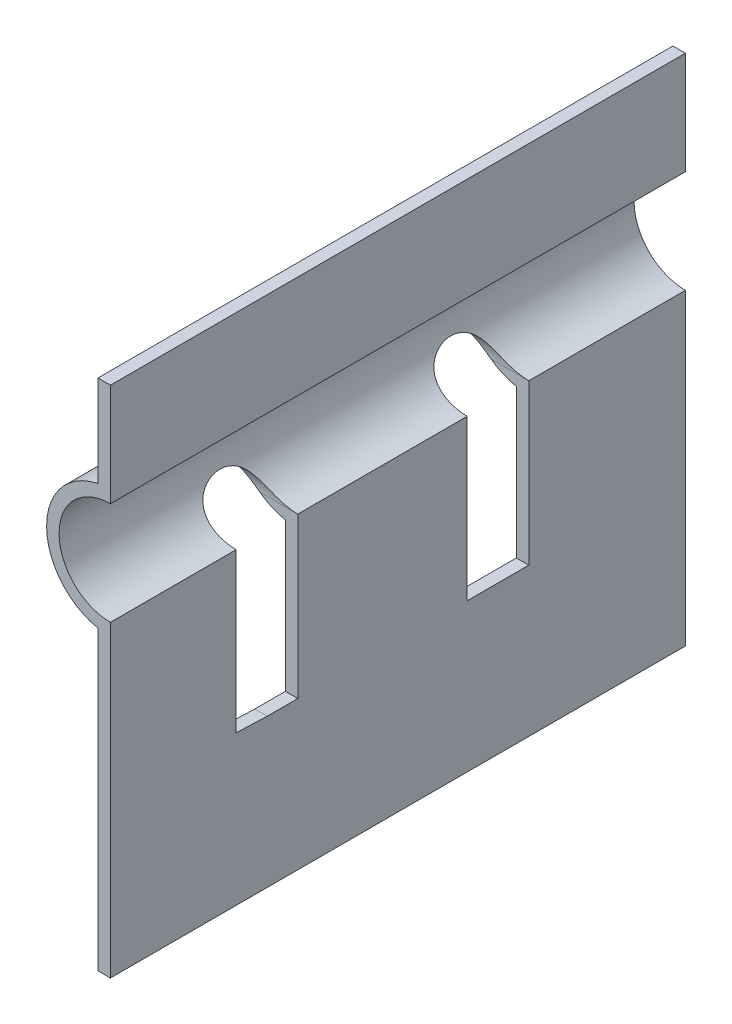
from build123d import *

# Parameters (mm, degrees)
EXTRUDE1_DEPTH = 56
EXTRUDE2_DEPTH = 56


with BuildPart() as part:
    # Sketch1 → Extrude1 (new body)
    with BuildSketch(Plane.XY):
        with BuildLine():
            Line((0, 0), (0, -10))
            ThreePointArc((0, -10), (-5, -15), (0, -20))
            Line((0, -20), (0, -50))
            Line((0, -50), (-1.214, -50))
            Line((-1.214, -50), (-1.214, -21.094259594))
            ThreePointArc((-1.214, -21.094259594), (-6.214, -15), (-1.214, -8.905740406))
            Line((-1.214, -8.905740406), (-1.214, 0))
            Line((-1.214, 0), (0, 0))
        make_face()
    extrude(amount=EXTRUDE1_DEPTH)

    # Sketch2 → Extrude2 (cut)
    with BuildSketch(Plane(origin=(0, 0, 0), x_dir=(0, 0, -1), z_dir=(1, 0, 0))):
        with BuildLine():
            Line((-43.75, -35.444714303), (-40.724672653, -35.555699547))
            Line((-40.724672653, -35.555699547), (-37.75, -35.555699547))
            Line((-37.75, -35.555699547), (-37.75, -20))
            ThreePointArc((-37.75, -20), (-40.75, -17), (-43.75, -20))
            Line((-43.75, -20), (-43.75, -35.444714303))
        make_face()
        with BuildLine():
            Line((-15.25, -20), (-15.25, -35.555699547))
            Line((-15.25, -35.555699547), (-21.25, -35.555699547))
            Line((-21.25, -35.555699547), (-21.25, -20))
            ThreePointArc((-21.25, -20), (-18.25, -17), (-15.25, -20))
        make_face()
    extrude(amount=-EXTRUDE2_DEPTH, mode=Mode.SUBTRACT)


solid = part.part
